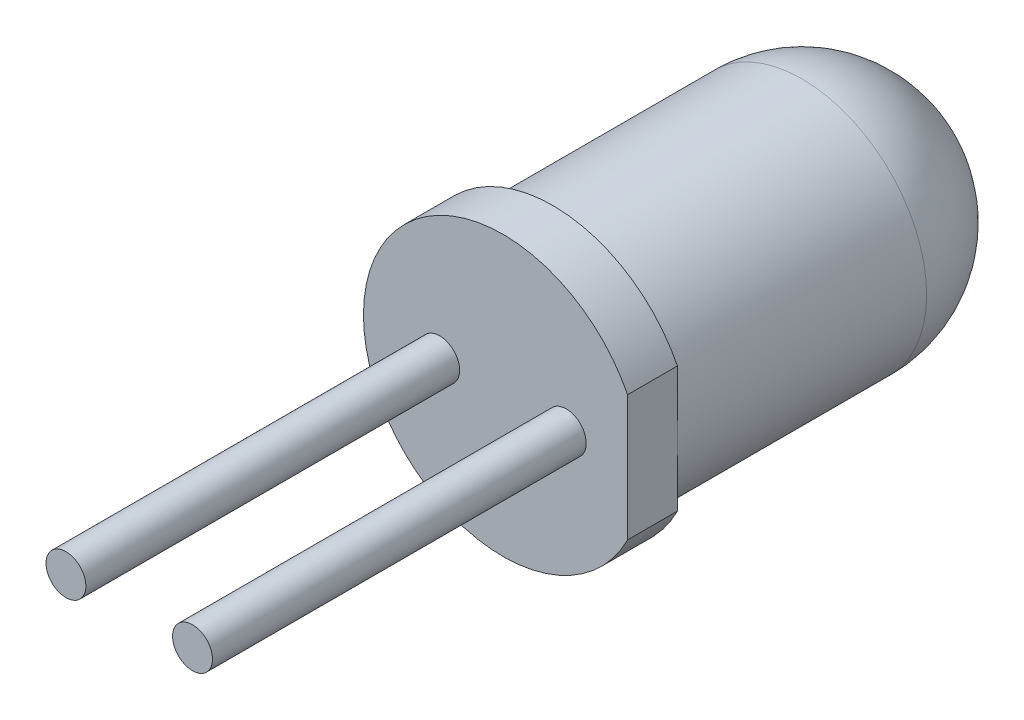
ISO-10303-21;
HEADER;
FILE_DESCRIPTION(('STEP AP214'),'2;1');
FILE_NAME('part.step','',(''),(''),'','','');
FILE_SCHEMA(('AUTOMOTIVE_DESIGN { 1 0 10303 214 1 1 1 1 }'));
ENDSEC;
DATA;
#1=APPLICATION_CONTEXT('core data for automotive mechanical design processes');
#2=APPLICATION_PROTOCOL_DEFINITION('international standard','automotive_design',2000,#1);
#3=PRODUCT_CONTEXT('',#1,'mechanical');
#4=PRODUCT('Part','Part','',(#3));
#5=PRODUCT_RELATED_PRODUCT_CATEGORY('part','',(#4));
#6=PRODUCT_DEFINITION_FORMATION('','',#4);
#7=PRODUCT_DEFINITION_CONTEXT('part definition',#1,'design');
#8=PRODUCT_DEFINITION('design','',#6,#7);
#9=PRODUCT_DEFINITION_SHAPE('','',#8);
#10=(LENGTH_UNIT() NAMED_UNIT(*) SI_UNIT(.MILLI.,.METRE.));
#11=(NAMED_UNIT(*) PLANE_ANGLE_UNIT() SI_UNIT($,.RADIAN.));
#12=(NAMED_UNIT(*) SI_UNIT($,.STERADIAN.) SOLID_ANGLE_UNIT());
#13=UNCERTAINTY_MEASURE_WITH_UNIT(LENGTH_MEASURE(1.E-05),#10,'distance_accuracy_value','');
#14=(GEOMETRIC_REPRESENTATION_CONTEXT(3) GLOBAL_UNCERTAINTY_ASSIGNED_CONTEXT((#13)) GLOBAL_UNIT_ASSIGNED_CONTEXT((#10,
#11,#12)) REPRESENTATION_CONTEXT('',''));
#15=CARTESIAN_POINT('',(0.,0.,0.));
#16=DIRECTION('',(0.,0.,1.));
#17=DIRECTION('',(1.,0.,0.));
#18=AXIS2_PLACEMENT_3D('',#15,#16,#17);
#19=CARTESIAN_POINT('',(0.,0.,8.5));
#20=DIRECTION('',(0.,0.,-1.));
#21=DIRECTION('',(-1.,0.,0.));
#22=AXIS2_PLACEMENT_3D('',#19,#20,#21);
#23=CYLINDRICAL_SURFACE('',#22,2.5);
#24=CARTESIAN_POINT('',(0.,0.,2.5));
#25=DIRECTION('',(0.,0.,-1.));
#26=DIRECTION('',(-1.,0.,0.));
#27=AXIS2_PLACEMENT_3D('',#24,#25,#26);
#28=CIRCLE('',#27,2.5);
#29=CARTESIAN_POINT('',(-2.5,0.,2.5));
#30=VERTEX_POINT('',#29);
#31=EDGE_CURVE('E11',#30,#30,#28,.F.);
#32=ORIENTED_EDGE('',*,*,#31,.T.);
#33=EDGE_LOOP('',(#32));
#34=FACE_BOUND('',#33,.T.);
#35=CARTESIAN_POINT('',(0.,0.,7.5));
#36=DIRECTION('',(0.,0.,1.));
#37=DIRECTION('',(1.,0.,0.));
#38=AXIS2_PLACEMENT_3D('',#35,#36,#37);
#39=CIRCLE('',#38,2.5);
#40=CARTESIAN_POINT('',(2.5,0.,7.5));
#41=VERTEX_POINT('',#40);
#42=EDGE_CURVE('E40',#41,#41,#39,.T.);
#43=ORIENTED_EDGE('',*,*,#42,.F.);
#44=EDGE_LOOP('',(#43));
#45=FACE_BOUND('',#44,.T.);
#46=ADVANCED_FACE('F33',(#34,#45),#23,.T.);
#47=CARTESIAN_POINT('',(0.,0.,7.5));
#48=DIRECTION('',(0.,0.,1.));
#49=DIRECTION('',(1.,0.,0.));
#50=AXIS2_PLACEMENT_3D('',#47,#48,#49);
#51=PLANE('',#50);
#52=DIRECTION('',(0.,1.,0.));
#53=VECTOR('',#52,1.);
#54=CARTESIAN_POINT('',(2.5,1.26095202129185,7.5));
#55=LINE('',#54,#53);
#56=CARTESIAN_POINT('',(2.5,1.26095202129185,7.5));
#57=VERTEX_POINT('',#56);
#58=EDGE_CURVE('E51',#41,#57,#55,.T.);
#59=ORIENTED_EDGE('',*,*,#58,.F.);
#60=ORIENTED_EDGE('',*,*,#42,.T.);
#61=CARTESIAN_POINT('',(2.5,-1.26095202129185,7.5));
#62=VERTEX_POINT('',#61);
#63=EDGE_CURVE('E73',#62,#41,#55,.T.);
#64=ORIENTED_EDGE('',*,*,#63,.F.);
#65=CARTESIAN_POINT('',(0.,0.,7.5));
#66=DIRECTION('',(0.,0.,1.));
#67=DIRECTION('',(1.,0.,0.));
#68=AXIS2_PLACEMENT_3D('',#65,#66,#67);
#69=CIRCLE('',#68,2.8);
#70=EDGE_CURVE('E69',#57,#62,#69,.T.);
#71=ORIENTED_EDGE('',*,*,#70,.F.);
#72=EDGE_LOOP('',(#59,#60,#64,#71));
#73=FACE_BOUND('',#72,.T.);
#74=ADVANCED_FACE('F87',(#73),#51,.F.);
#75=CARTESIAN_POINT('',(2.5,1.26095202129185,7.5));
#76=DIRECTION('',(1.,0.,0.));
#77=DIRECTION('',(0.,0.,-1.));
#78=AXIS2_PLACEMENT_3D('',#75,#76,#77);
#79=PLANE('',#78);
#80=ORIENTED_EDGE('',*,*,#63,.T.);
#81=ORIENTED_EDGE('',*,*,#58,.T.);
#82=DIRECTION('',(0.,0.,1.));
#83=VECTOR('',#82,1.);
#84=CARTESIAN_POINT('',(2.5,1.26095202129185,7.5));
#85=LINE('',#84,#83);
#86=CARTESIAN_POINT('',(2.5,1.26095202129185,8.5));
#87=VERTEX_POINT('',#86);
#88=EDGE_CURVE('E72',#57,#87,#85,.T.);
#89=ORIENTED_EDGE('',*,*,#88,.T.);
#90=DIRECTION('',(0.,1.,0.));
#91=VECTOR('',#90,1.);
#92=CARTESIAN_POINT('',(2.5,1.26095202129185,8.5));
#93=LINE('',#92,#91);
#94=CARTESIAN_POINT('',(2.5,-1.26095202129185,8.5));
#95=VERTEX_POINT('',#94);
#96=EDGE_CURVE('E77',#95,#87,#93,.T.);
#97=ORIENTED_EDGE('',*,*,#96,.F.);
#98=DIRECTION('',(0.,0.,1.));
#99=VECTOR('',#98,1.);
#100=CARTESIAN_POINT('',(2.5,-1.26095202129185,7.5));
#101=LINE('',#100,#99);
#102=EDGE_CURVE('E64',#62,#95,#101,.T.);
#103=ORIENTED_EDGE('',*,*,#102,.F.);
#104=EDGE_LOOP('',(#80,#81,#89,#97,#103));
#105=FACE_BOUND('',#104,.T.);
#106=ADVANCED_FACE('F80',(#105),#79,.T.);
#107=CARTESIAN_POINT('',(0.,0.,7.5));
#108=DIRECTION('',(0.,0.,1.));
#109=DIRECTION('',(1.,0.,0.));
#110=AXIS2_PLACEMENT_3D('',#107,#108,#109);
#111=CYLINDRICAL_SURFACE('',#110,2.8);
#112=CARTESIAN_POINT('',(0.,0.,8.5));
#113=DIRECTION('',(0.,0.,1.));
#114=DIRECTION('',(1.,0.,0.));
#115=AXIS2_PLACEMENT_3D('',#112,#113,#114);
#116=CIRCLE('',#115,2.8);
#117=EDGE_CURVE('E67',#87,#95,#116,.T.);
#118=ORIENTED_EDGE('',*,*,#117,.F.);
#119=ORIENTED_EDGE('',*,*,#88,.F.);
#120=ORIENTED_EDGE('',*,*,#70,.T.);
#121=ORIENTED_EDGE('',*,*,#102,.T.);
#122=EDGE_LOOP('',(#118,#119,#120,#121));
#123=FACE_BOUND('',#122,.T.);
#124=ADVANCED_FACE('F66',(#123),#111,.T.);
#125=CARTESIAN_POINT('',(0.,0.,8.5));
#126=DIRECTION('',(0.,0.,1.));
#127=DIRECTION('',(1.,0.,0.));
#128=AXIS2_PLACEMENT_3D('',#125,#126,#127);
#129=PLANE('',#128);
#130=CARTESIAN_POINT('',(-1.27,0.,8.5));
#131=DIRECTION('',(0.,0.,1.));
#132=DIRECTION('',(-1.,0.,0.));
#133=AXIS2_PLACEMENT_3D('',#130,#131,#132);
#134=CIRCLE('',#133,0.4);
#135=CARTESIAN_POINT('',(-1.67,0.,8.5));
#136=VERTEX_POINT('',#135);
#137=EDGE_CURVE('E111',#136,#136,#134,.T.);
#138=ORIENTED_EDGE('',*,*,#137,.F.);
#139=EDGE_LOOP('',(#138));
#140=FACE_BOUND('',#139,.T.);
#141=CARTESIAN_POINT('',(1.27,0.,8.5));
#142=DIRECTION('',(0.,0.,1.));
#143=DIRECTION('',(1.,0.,0.));
#144=AXIS2_PLACEMENT_3D('',#141,#142,#143);
#145=CIRCLE('',#144,0.4);
#146=CARTESIAN_POINT('',(1.67,0.,8.5));
#147=VERTEX_POINT('',#146);
#148=EDGE_CURVE('E114',#147,#147,#145,.T.);
#149=ORIENTED_EDGE('',*,*,#148,.F.);
#150=EDGE_LOOP('',(#149));
#151=FACE_BOUND('',#150,.T.);
#152=ORIENTED_EDGE('',*,*,#96,.T.);
#153=ORIENTED_EDGE('',*,*,#117,.T.);
#154=EDGE_LOOP('',(#152,#153));
#155=FACE_BOUND('',#154,.T.);
#156=ADVANCED_FACE('F76',(#140,#151,#155),#129,.T.);
#157=CARTESIAN_POINT('',(0.,0.,2.5));
#158=DIRECTION('',(0.,0.,1.));
#159=DIRECTION('',(1.,0.,0.));
#160=AXIS2_PLACEMENT_3D('',#157,#158,#159);
#161=SPHERICAL_SURFACE('',#160,2.5);
#162=ORIENTED_EDGE('',*,*,#31,.F.);
#163=EDGE_LOOP('',(#162));
#164=FACE_BOUND('',#163,.T.);
#165=ADVANCED_FACE('F97',(#164),#161,.T.);
#166=CARTESIAN_POINT('',(1.27,0.,16.));
#167=DIRECTION('',(0.,0.,-1.));
#168=DIRECTION('',(-1.,0.,0.));
#169=AXIS2_PLACEMENT_3D('',#166,#167,#168);
#170=CYLINDRICAL_SURFACE('',#169,0.4);
#171=CARTESIAN_POINT('',(1.27,0.,16.));
#172=DIRECTION('',(0.,0.,1.));
#173=DIRECTION('',(1.,0.,0.));
#174=AXIS2_PLACEMENT_3D('',#171,#172,#173);
#175=CIRCLE('',#174,0.4);
#176=CARTESIAN_POINT('',(1.67,0.,16.));
#177=VERTEX_POINT('',#176);
#178=EDGE_CURVE('E78',#177,#177,#175,.T.);
#179=ORIENTED_EDGE('',*,*,#178,.F.);
#180=EDGE_LOOP('',(#179));
#181=FACE_BOUND('',#180,.T.);
#182=ORIENTED_EDGE('',*,*,#148,.T.);
#183=EDGE_LOOP('',(#182));
#184=FACE_BOUND('',#183,.T.);
#185=ADVANCED_FACE('F106',(#181,#184),#170,.T.);
#186=CARTESIAN_POINT('',(1.27,0.,16.));
#187=DIRECTION('',(0.,0.,1.));
#188=DIRECTION('',(1.,0.,0.));
#189=AXIS2_PLACEMENT_3D('',#186,#187,#188);
#190=PLANE('',#189);
#191=ORIENTED_EDGE('',*,*,#178,.T.);
#192=EDGE_LOOP('',(#191));
#193=FACE_BOUND('',#192,.T.);
#194=ADVANCED_FACE('F126',(#193),#190,.T.);
#195=CARTESIAN_POINT('',(-1.27,0.,16.));
#196=DIRECTION('',(0.,0.,-1.));
#197=DIRECTION('',(-1.,0.,0.));
#198=AXIS2_PLACEMENT_3D('',#195,#196,#197);
#199=CYLINDRICAL_SURFACE('',#198,0.4);
#200=CARTESIAN_POINT('',(-1.27,0.,16.));
#201=DIRECTION('',(0.,0.,1.));
#202=DIRECTION('',(-1.,0.,0.));
#203=AXIS2_PLACEMENT_3D('',#200,#201,#202);
#204=CIRCLE('',#203,0.4);
#205=CARTESIAN_POINT('',(-1.67,0.,16.));
#206=VERTEX_POINT('',#205);
#207=EDGE_CURVE('E116',#206,#206,#204,.T.);
#208=ORIENTED_EDGE('',*,*,#207,.F.);
#209=EDGE_LOOP('',(#208));
#210=FACE_BOUND('',#209,.T.);
#211=ORIENTED_EDGE('',*,*,#137,.T.);
#212=EDGE_LOOP('',(#211));
#213=FACE_BOUND('',#212,.T.);
#214=ADVANCED_FACE('F123',(#210,#213),#199,.T.);
#215=CARTESIAN_POINT('',(-1.27,0.,16.));
#216=DIRECTION('',(0.,0.,-1.));
#217=DIRECTION('',(-1.,0.,0.));
#218=AXIS2_PLACEMENT_3D('',#215,#216,#217);
#219=PLANE('',#218);
#220=ORIENTED_EDGE('',*,*,#207,.T.);
#221=EDGE_LOOP('',(#220));
#222=FACE_BOUND('',#221,.T.);
#223=ADVANCED_FACE('F125',(#222),#219,.F.);
#224=CLOSED_SHELL('',(#46,#74,#106,#124,#156,#165,#185,#194,#214,#223));
#225=MANIFOLD_SOLID_BREP('B2',#224);
#226=ADVANCED_BREP_SHAPE_REPRESENTATION('',(#18,#225),#14);
#227=SHAPE_DEFINITION_REPRESENTATION(#9,#226);
ENDSEC;
END-ISO-10303-21;
